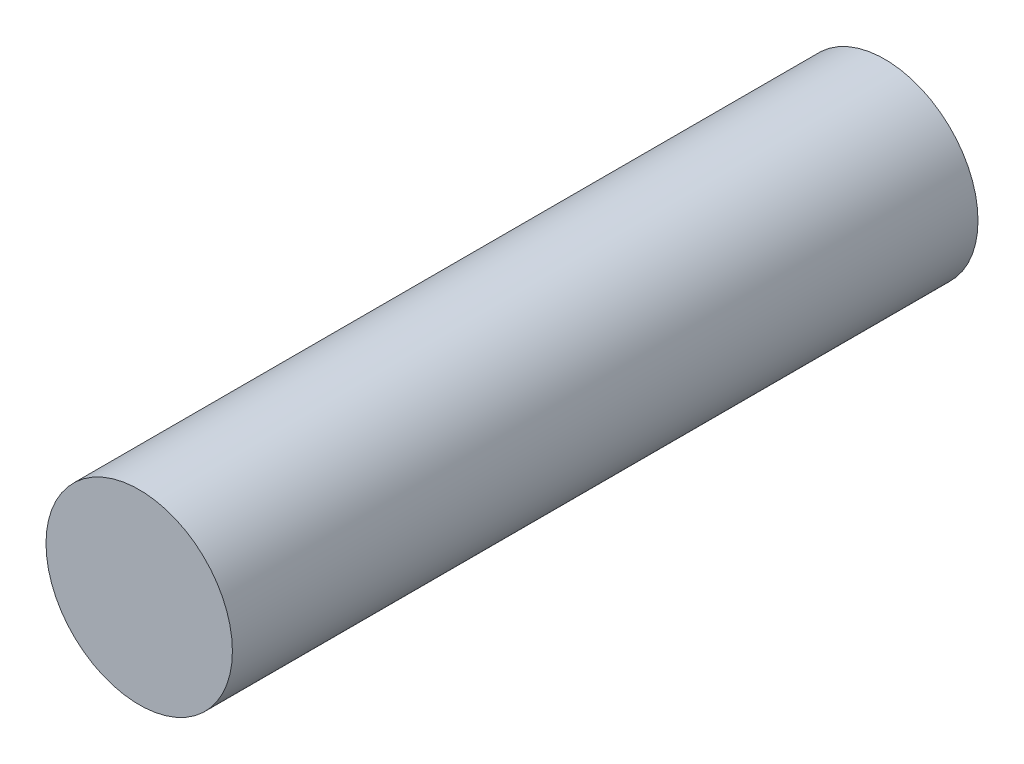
ISO-10303-21;
HEADER;
FILE_DESCRIPTION(('STEP AP214'),'2;1');
FILE_NAME('part.step','',(''),(''),'','','');
FILE_SCHEMA(('AUTOMOTIVE_DESIGN { 1 0 10303 214 1 1 1 1 }'));
ENDSEC;
DATA;
#1=APPLICATION_CONTEXT('core data for automotive mechanical design processes');
#2=APPLICATION_PROTOCOL_DEFINITION('international standard','automotive_design',2000,#1);
#3=PRODUCT_CONTEXT('',#1,'mechanical');
#4=PRODUCT('Part','Part','',(#3));
#5=PRODUCT_RELATED_PRODUCT_CATEGORY('part','',(#4));
#6=PRODUCT_DEFINITION_FORMATION('','',#4);
#7=PRODUCT_DEFINITION_CONTEXT('part definition',#1,'design');
#8=PRODUCT_DEFINITION('design','',#6,#7);
#9=PRODUCT_DEFINITION_SHAPE('','',#8);
#10=(LENGTH_UNIT() NAMED_UNIT(*) SI_UNIT(.MILLI.,.METRE.));
#11=(NAMED_UNIT(*) PLANE_ANGLE_UNIT() SI_UNIT($,.RADIAN.));
#12=(NAMED_UNIT(*) SI_UNIT($,.STERADIAN.) SOLID_ANGLE_UNIT());
#13=UNCERTAINTY_MEASURE_WITH_UNIT(LENGTH_MEASURE(1.E-05),#10,'distance_accuracy_value','');
#14=(GEOMETRIC_REPRESENTATION_CONTEXT(3) GLOBAL_UNCERTAINTY_ASSIGNED_CONTEXT((#13)) GLOBAL_UNIT_ASSIGNED_CONTEXT((#10,
#11,#12)) REPRESENTATION_CONTEXT('',''));
#15=CARTESIAN_POINT('',(0.,0.,0.));
#16=DIRECTION('',(0.,0.,1.));
#17=DIRECTION('',(1.,0.,0.));
#18=AXIS2_PLACEMENT_3D('',#15,#16,#17);
#19=CARTESIAN_POINT('',(0.,0.,100.));
#20=DIRECTION('',(0.,0.,-1.));
#21=DIRECTION('',(-1.,0.,0.));
#22=AXIS2_PLACEMENT_3D('',#19,#20,#21);
#23=CYLINDRICAL_SURFACE('',#22,12.5);
#24=CARTESIAN_POINT('',(0.,0.,100.));
#25=DIRECTION('',(0.,0.,1.));
#26=DIRECTION('',(1.,0.,0.));
#27=AXIS2_PLACEMENT_3D('',#24,#25,#26);
#28=CIRCLE('',#27,12.5);
#29=CARTESIAN_POINT('',(12.5,0.,100.));
#30=VERTEX_POINT('',#29);
#31=EDGE_CURVE('E10',#30,#30,#28,.T.);
#32=ORIENTED_EDGE('',*,*,#31,.F.);
#33=EDGE_LOOP('',(#32));
#34=FACE_BOUND('',#33,.T.);
#35=CARTESIAN_POINT('',(0.,0.,0.));
#36=DIRECTION('',(0.,0.,1.));
#37=DIRECTION('',(1.,0.,0.));
#38=AXIS2_PLACEMENT_3D('',#35,#36,#37);
#39=CIRCLE('',#38,12.5);
#40=CARTESIAN_POINT('',(12.5,0.,0.));
#41=VERTEX_POINT('',#40);
#42=EDGE_CURVE('E35',#41,#41,#39,.T.);
#43=ORIENTED_EDGE('',*,*,#42,.T.);
#44=EDGE_LOOP('',(#43));
#45=FACE_BOUND('',#44,.T.);
#46=ADVANCED_FACE('F32',(#34,#45),#23,.T.);
#47=CARTESIAN_POINT('',(0.,0.,100.));
#48=DIRECTION('',(0.,0.,1.));
#49=DIRECTION('',(1.,0.,0.));
#50=AXIS2_PLACEMENT_3D('',#47,#48,#49);
#51=PLANE('',#50);
#52=ORIENTED_EDGE('',*,*,#31,.T.);
#53=EDGE_LOOP('',(#52));
#54=FACE_BOUND('',#53,.T.);
#55=ADVANCED_FACE('F47',(#54),#51,.T.);
#56=CARTESIAN_POINT('',(0.,0.,0.));
#57=DIRECTION('',(0.,0.,1.));
#58=DIRECTION('',(1.,0.,0.));
#59=AXIS2_PLACEMENT_3D('',#56,#57,#58);
#60=PLANE('',#59);
#61=ORIENTED_EDGE('',*,*,#42,.F.);
#62=EDGE_LOOP('',(#61));
#63=FACE_BOUND('',#62,.T.);
#64=ADVANCED_FACE('F45',(#63),#60,.F.);
#65=CLOSED_SHELL('',(#46,#55,#64));
#66=MANIFOLD_SOLID_BREP('B2',#65);
#67=ADVANCED_BREP_SHAPE_REPRESENTATION('',(#18,#66),#14);
#68=SHAPE_DEFINITION_REPRESENTATION(#9,#67);
ENDSEC;
END-ISO-10303-21;
